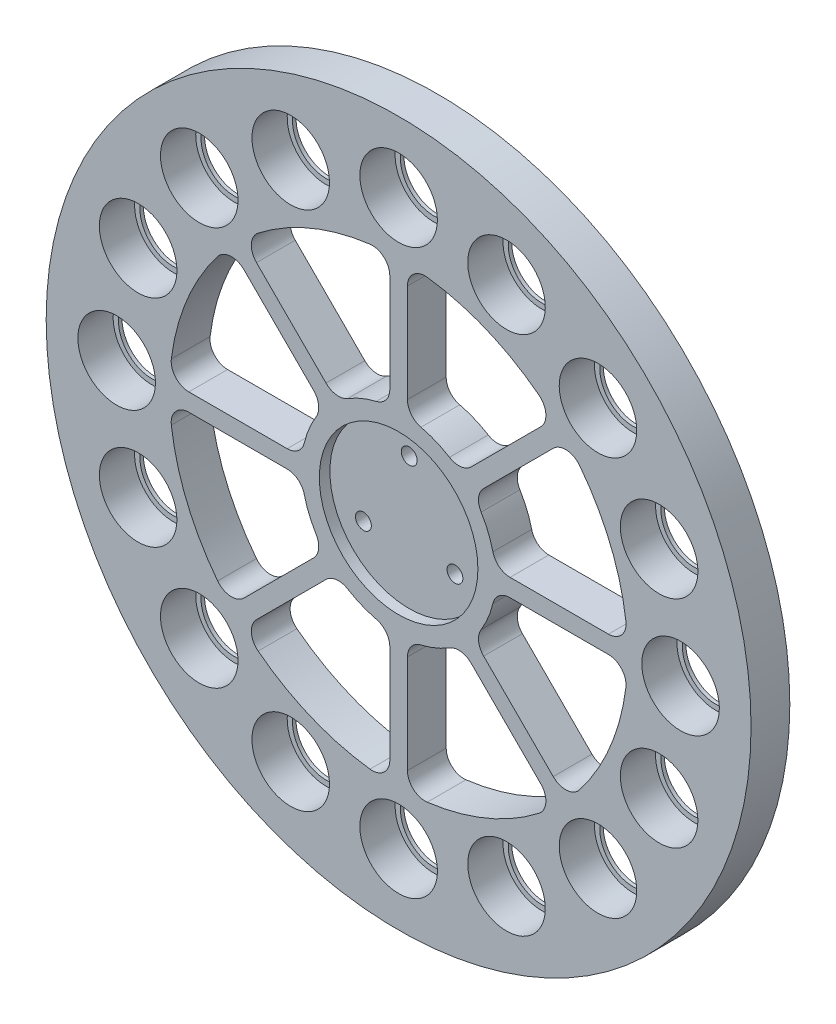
from build123d import *

# Parameters (mm, degrees)
SKETCH1_R                                       = 100
BOSS_EXTRUDE1_DEPTH                             = 11
SKETCH2_R                                       = 11
CUT_EXTRUDE1_DEPTH                              = 10
CIRPATTERN1_COUNT                               = 16
SKETCH12_R                                      = 9.5
CUT_EXTRUDE3_DEPTH                              = 142.848510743
CIRPATTERN4_COUNT                               = 16
CSK_FOR_M4_FLAT_HEAD_MACHINE_SCREW1_D           = 4.5
CSK_FOR_M4_FLAT_HEAD_MACHINE_SCREW1_CSINK_D     = 9.4
CSK_FOR_M4_FLAT_HEAD_MACHINE_SCREW1_CSINK_ANGLE = 90
SKETCH24_R                                      = 22.5
CUT_EXTRUDE5_DEPTH                              = 3
CIRPATTERN5_COUNT                               = 3
CUT_EXTRUDE6_DEPTH                              = 142.848510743
FILLET1_R                                       = 5
CIRPATTERN6_COUNT                               = 8
FILLET1_OF_CIRPATTERN6_R                        = 5


with BuildPart() as part:
    # Sketch1 → Boss-Extrude1 (new body)
    with BuildSketch(Plane.XY):
        Circle(SKETCH1_R)
    extrude(amount=BOSS_EXTRUDE1_DEPTH)

    # Sketch2 → Cut-Extrude1 (cut)
    with BuildSketch(Plane.XY.offset(11)):
        with Locations((0, 80)):
            Circle(SKETCH2_R)
    cut_extrude1 = extrude(amount=-CUT_EXTRUDE1_DEPTH, mode=Mode.SUBTRACT)

    # CirPattern1: Cut-Extrude1 ×16 about axis
    cirpattern1_axis = Axis((0, 0, 0), (0, 0, 1))
    for i in range(1, CIRPATTERN1_COUNT):
        add(cut_extrude1.rotate(cirpattern1_axis, i * 360 / CIRPATTERN1_COUNT), mode=Mode.SUBTRACT)

    # Sketch12 → Cut-Extrude3 (cut, through all)
    with BuildSketch(Plane.XY.offset(11)):
        with Locations((0, 80)):
            Circle(SKETCH12_R)
    cut_extrude3 = extrude(amount=-CUT_EXTRUDE3_DEPTH, mode=Mode.SUBTRACT)

    # CirPattern4: Cut-Extrude3 ×16 about axis
    cirpattern4_axis = Axis((0, 0, 0), (0, 0, 1))
    for i in range(1, CIRPATTERN4_COUNT):
        add(cut_extrude3.rotate(cirpattern4_axis, i * 360 / CIRPATTERN4_COUNT), mode=Mode.SUBTRACT)

    # CSK for M4 Flat Head Machine Screw1 (through all)
    with Locations(Plane(origin=(0, 0, 0), x_dir=(-1, 0, 0), z_dir=(0, 0, -1))):
        with Locations((0, 15)):
            csk_for_m4_flat_head_machine_screw1 = CounterSinkHole(CSK_FOR_M4_FLAT_HEAD_MACHINE_SCREW1_D / 2, CSK_FOR_M4_FLAT_HEAD_MACHINE_SCREW1_CSINK_D / 2, counter_sink_angle=CSK_FOR_M4_FLAT_HEAD_MACHINE_SCREW1_CSINK_ANGLE)

    # Sketch24 → Cut-Extrude5 (cut)
    with BuildSketch(Plane.XY.offset(11)):
        Circle(SKETCH24_R)
    extrude(amount=-CUT_EXTRUDE5_DEPTH, mode=Mode.SUBTRACT)

    # CirPattern5: CSK for M4 Flat Head Machine Screw1 ×3 about axis
    cirpattern5_axis = Axis((0, 0, 0), (0, 0, 1))
    for i in range(1, CIRPATTERN5_COUNT):
        add(csk_for_m4_flat_head_machine_screw1.rotate(cirpattern5_axis, i * 360 / CIRPATTERN5_COUNT), mode=Mode.SUBTRACT)

    # Sketch25 → Cut-Extrude6 (cut, through all)
    with BuildSketch(Plane.XY.offset(11)):
        with BuildLine():
            Line((2.5, 27.386127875), (2.5, 64.951905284))
            ThreePointArc((2.5, 64.951905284), (24.874423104, 60.052169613), (44.160165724, 47.69569963))
            Line((44.160165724, 47.69569963), (17.597149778, 21.132683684))
            ThreePointArc((17.597149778, 21.132683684), (10.52379439, 25.406687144), (2.5, 27.386127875))
        make_face()
    cut_extrude6 = extrude(amount=-CUT_EXTRUDE6_DEPTH, mode=Mode.SUBTRACT)

    # Fillet1
    fillet1_edges = [part.edges().sort_by_distance(p)[0] for p in [
        (17.597149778, 21.132683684, 5.5),
        (2.5, 27.386127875, 5.5),
        (2.5, 64.951905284, 5.5),
        (44.160165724, 47.69569963, 5.5),
    ]]
    fillet(fillet1_edges, radius=FILLET1_R)

    # CirPattern6: Cut-Extrude6 ×8 about axis
    cirpattern6_axis = Axis((0, 0, 0), (0, 0, 1))
    for i in range(1, CIRPATTERN6_COUNT):
        add(cut_extrude6.rotate(cirpattern6_axis, i * 360 / CIRPATTERN6_COUNT), mode=Mode.SUBTRACT)

    # Fillet1 of CirPattern6
    fillet1_of_cirpattern6_edges = [part.edges().sort_by_distance(p)[0] for p in [
        (-2.5, 27.386127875, 5.5),
        (-17.597149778, 21.132683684, 5.5),
        (-44.160165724, 47.69569963, 5.5),
        (-2.5, 64.951905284, 5.5),
        (-21.132683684, 17.597149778, 5.5),
        (-27.386127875, 2.5, 5.5),
        (-64.951905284, 2.5, 5.5),
        (-47.69569963, 44.160165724, 5.5),
        (-27.386127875, -2.5, 5.5),
        (-21.132683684, -17.597149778, 5.5),
        (-47.69569963, -44.160165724, 5.5),
        (-64.951905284, -2.5, 5.5),
        (-17.597149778, -21.132683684, 5.5),
        (-2.5, -27.386127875, 5.5),
        (-2.5, -64.951905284, 5.5),
        (-44.160165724, -47.69569963, 5.5),
        (2.5, -27.386127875, 5.5),
        (17.597149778, -21.132683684, 5.5),
        (44.160165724, -47.69569963, 5.5),
        (2.5, -64.951905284, 5.5),
        (21.132683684, -17.597149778, 5.5),
        (27.386127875, -2.5, 5.5),
        (64.951905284, -2.5, 5.5),
        (47.69569963, -44.160165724, 5.5),
        (27.386127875, 2.5, 5.5),
        (21.132683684, 17.597149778, 5.5),
        (47.69569963, 44.160165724, 5.5),
        (64.951905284, 2.5, 5.5),
    ]]
    fillet(fillet1_of_cirpattern6_edges, radius=FILLET1_OF_CIRPATTERN6_R)


solid = part.part
